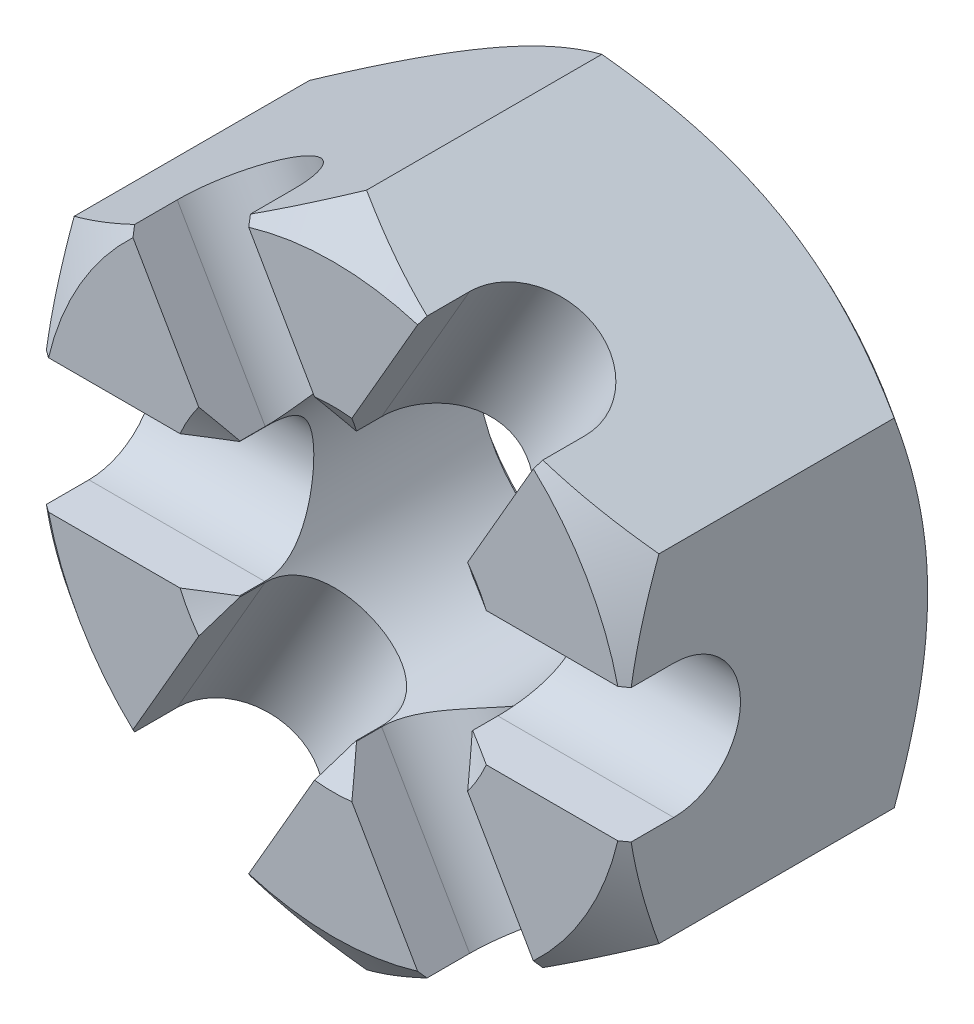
from build123d import *

# Parameters (mm, degrees)
BASENUT_START     = -5.7404
BASENUTSKE_R      = 2.5527
BASENUT_DEPTH     = 5.7404
SLOT_DEPTH        = 15.057112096
SLOTPATTERN_COUNT = 3
SLOTPATTERN_ANGLE = 120


with BuildPart() as part:
    # BaseNutSke → BaseNut (new body)
    with BuildSketch(Plane.XY.offset(BASENUT_START)):
        Polygon((5.55625, 3.207902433), (5.55625, -3.207902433), (0, -6.415804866), (-5.55625, -3.207902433), (-5.55625, 3.207902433), (0, 6.415804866), align=None)
        Circle(BASENUTSKE_R, mode=Mode.SUBTRACT)
    extrude(amount=BASENUT_DEPTH)

    # Sketch4 → Slot (cut, through all)
    with BuildSketch(Plane(origin=(5.55625, 0, 0), x_dir=(0, 0, -1), z_dir=(1, 0, 0))):
        with BuildLine():
            Line((0.9144, 1.27), (0, 1.27))
            Line((0, 1.27), (0, -1.27))
            Line((0, -1.27), (0.9144, -1.27))
            ThreePointArc((0.9144, -1.27), (2.1844, 0), (0.9144, 1.27))
        make_face()
    slot = extrude(amount=-SLOT_DEPTH, mode=Mode.SUBTRACT)

    # SlotPattern: Slot ×3 about axis
    slotpattern_axis = Axis((0, 0, 0), (0, 0, 1))
    for i in range(1, SLOTPATTERN_COUNT):
        add(slot.rotate(slotpattern_axis, i * SLOTPATTERN_ANGLE / (SLOTPATTERN_COUNT - 1)), mode=Mode.SUBTRACT)

    # Sketch3 → Double-Chamfer (revolve, cut)
    with BuildSketch(Plane(origin=(0, 0, 0), x_dir=(0, 0, -1), z_dir=(1, 0, 0)), mode=Mode.PRIVATE) as double_chamfer_sk:
        Polygon((5.7404, 5.55625), (5.1054, 6.415804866), (5.1054, 19.115804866), (18.4404, 19.115804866), (18.4404, 5.55625), align=None)
        Polygon((0.635, 6.415804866), (0.635, 19.115804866), (-12.7, 19.115804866), (-12.7, 5.55625), (0, 5.55625), align=None)
    revolve(double_chamfer_sk.sketch.rotate(Axis((0, 0, 0), (0, 0, -1)), 90), axis=Axis((0, 0, 0), (0, 0, -1)), mode=Mode.SUBTRACT)

    # EndChamferSketch → EndChamfer (revolve, cut)
    with BuildSketch(Plane(origin=(0, 0, 0), x_dir=(0, 0, -1), z_dir=(1, 0, 0)), mode=Mode.PRIVATE) as endchamfer_sk:
        Polygon((5.715, 3.175), (5.235686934, 2.49047), (5.7658, 2.49047), (5.7658, 3.175), align=None)
        Polygon((-0.0508, 3.175), (0, 3.175), (0.479313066, 2.49047), (-0.0508, 2.49047), align=None)
    revolve(endchamfer_sk.sketch.rotate(Axis((0, 0, -25.037505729), (0, 0, -1)), 119.835560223), axis=Axis((0, 0, -25.037505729), (0, 0, -1)), mode=Mode.SUBTRACT)


solid = part.part
